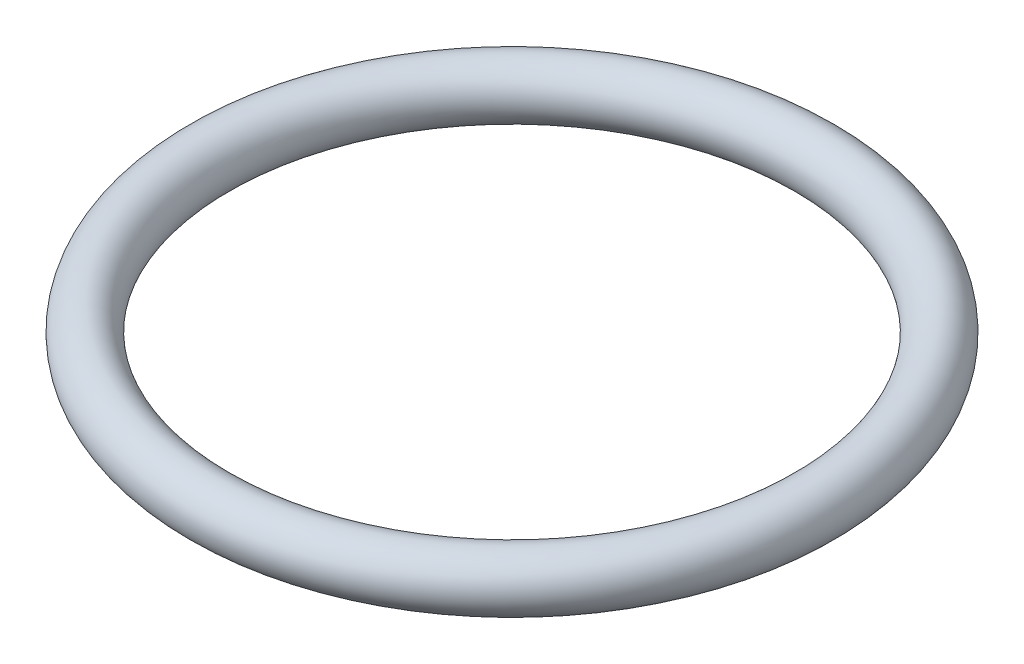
ISO-10303-21;
HEADER;
FILE_DESCRIPTION(('STEP AP214'),'2;1');
FILE_NAME('part.step','',(''),(''),'','','');
FILE_SCHEMA(('AUTOMOTIVE_DESIGN { 1 0 10303 214 1 1 1 1 }'));
ENDSEC;
DATA;
#1=APPLICATION_CONTEXT('core data for automotive mechanical design processes');
#2=APPLICATION_PROTOCOL_DEFINITION('international standard','automotive_design',2000,#1);
#3=PRODUCT_CONTEXT('',#1,'mechanical');
#4=PRODUCT('Part','Part','',(#3));
#5=PRODUCT_RELATED_PRODUCT_CATEGORY('part','',(#4));
#6=PRODUCT_DEFINITION_FORMATION('','',#4);
#7=PRODUCT_DEFINITION_CONTEXT('part definition',#1,'design');
#8=PRODUCT_DEFINITION('design','',#6,#7);
#9=PRODUCT_DEFINITION_SHAPE('','',#8);
#10=(LENGTH_UNIT() NAMED_UNIT(*) SI_UNIT(.MILLI.,.METRE.));
#11=(NAMED_UNIT(*) PLANE_ANGLE_UNIT() SI_UNIT($,.RADIAN.));
#12=(NAMED_UNIT(*) SI_UNIT($,.STERADIAN.) SOLID_ANGLE_UNIT());
#13=UNCERTAINTY_MEASURE_WITH_UNIT(LENGTH_MEASURE(1.E-05),#10,'distance_accuracy_value','');
#14=(GEOMETRIC_REPRESENTATION_CONTEXT(3) GLOBAL_UNCERTAINTY_ASSIGNED_CONTEXT((#13)) GLOBAL_UNIT_ASSIGNED_CONTEXT((#10,
#11,#12)) REPRESENTATION_CONTEXT('',''));
#15=CARTESIAN_POINT('',(0.,0.,0.));
#16=DIRECTION('',(0.,0.,1.));
#17=DIRECTION('',(1.,0.,0.));
#18=AXIS2_PLACEMENT_3D('',#15,#16,#17);
#19=CARTESIAN_POINT('',(0.,0.5,0.));
#20=DIRECTION('',(0.,1.,0.));
#21=DIRECTION('',(0.,0.,1.));
#22=AXIS2_PLACEMENT_3D('',#19,#20,#21);
#23=TOROIDAL_SURFACE('',#22,5.5,0.499999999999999);
#24=CARTESIAN_POINT('',(0.,0.500000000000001,6.));
#25=VERTEX_POINT('',#24);
#26=VERTEX_LOOP('',#25);
#27=FACE_BOUND('',#26,.T.);
#28=ADVANCED_FACE('F29',(#27),#23,.T.);
#29=CLOSED_SHELL('',(#28));
#30=MANIFOLD_SOLID_BREP('B2',#29);
#31=ADVANCED_BREP_SHAPE_REPRESENTATION('',(#18,#30),#14);
#32=SHAPE_DEFINITION_REPRESENTATION(#9,#31);
ENDSEC;
END-ISO-10303-21;
